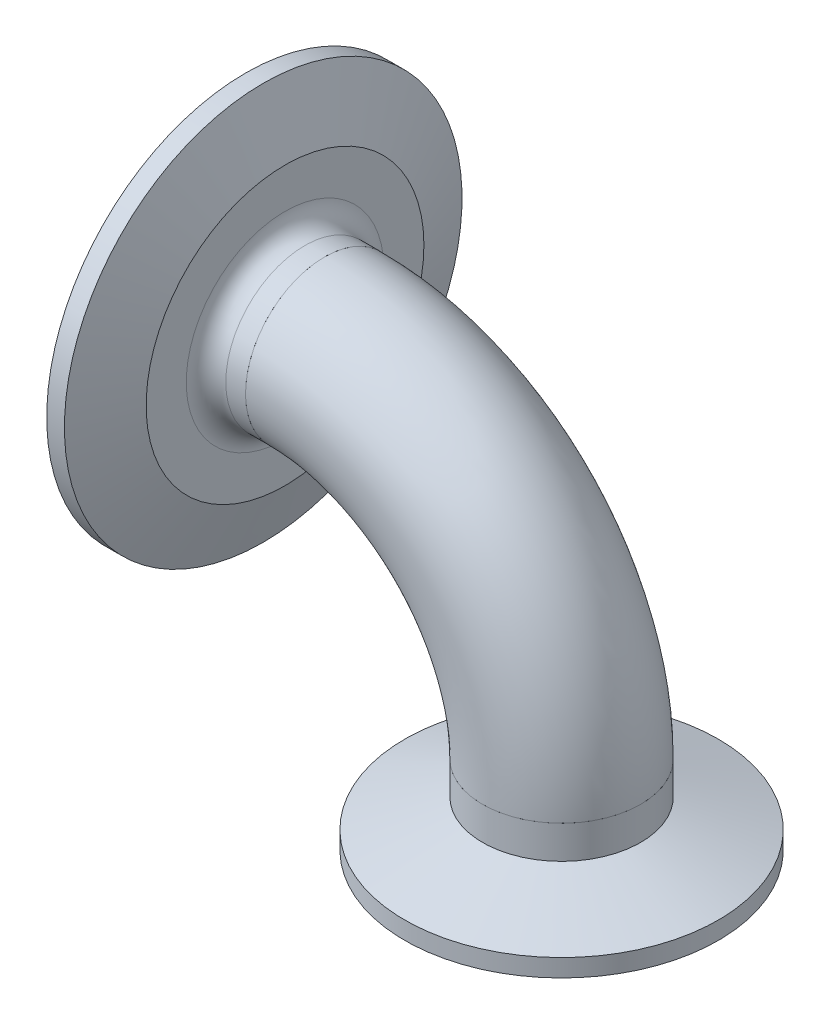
ISO-10303-21;
HEADER;
FILE_DESCRIPTION(('STEP AP214'),'2;1');
FILE_NAME('part.step','',(''),(''),'','','');
FILE_SCHEMA(('AUTOMOTIVE_DESIGN { 1 0 10303 214 1 1 1 1 }'));
ENDSEC;
DATA;
#1=APPLICATION_CONTEXT('core data for automotive mechanical design processes');
#2=APPLICATION_PROTOCOL_DEFINITION('international standard','automotive_design',2000,#1);
#3=PRODUCT_CONTEXT('',#1,'mechanical');
#4=PRODUCT('Part','Part','',(#3));
#5=PRODUCT_RELATED_PRODUCT_CATEGORY('part','',(#4));
#6=PRODUCT_DEFINITION_FORMATION('','',#4);
#7=PRODUCT_DEFINITION_CONTEXT('part definition',#1,'design');
#8=PRODUCT_DEFINITION('design','',#6,#7);
#9=PRODUCT_DEFINITION_SHAPE('','',#8);
#10=(LENGTH_UNIT() NAMED_UNIT(*) SI_UNIT(.MILLI.,.METRE.));
#11=(NAMED_UNIT(*) PLANE_ANGLE_UNIT() SI_UNIT($,.RADIAN.));
#12=(NAMED_UNIT(*) SI_UNIT($,.STERADIAN.) SOLID_ANGLE_UNIT());
#13=UNCERTAINTY_MEASURE_WITH_UNIT(LENGTH_MEASURE(1.E-05),#10,'distance_accuracy_value','');
#14=(GEOMETRIC_REPRESENTATION_CONTEXT(3) GLOBAL_UNCERTAINTY_ASSIGNED_CONTEXT((#13)) GLOBAL_UNIT_ASSIGNED_CONTEXT((#10,
#11,#12)) REPRESENTATION_CONTEXT('',''));
#15=CARTESIAN_POINT('',(0.,0.,0.));
#16=DIRECTION('',(0.,0.,1.));
#17=DIRECTION('',(1.,0.,0.));
#18=AXIS2_PLACEMENT_3D('',#15,#16,#17);
#19=CARTESIAN_POINT('',(7.06155520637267,16.9202870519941,51.7884539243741));
#20=DIRECTION('',(0.,0.,-1.));
#21=DIRECTION('',(-1.,0.,0.));
#22=AXIS2_PLACEMENT_3D('',#19,#20,#21);
#23=TOROIDAL_SURFACE('',#22,38.1,12.7);
#24=CARTESIAN_POINT('',(7.06155520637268,55.0202870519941,51.7884539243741));
#25=DIRECTION('',(-1.,0.,0.));
#26=DIRECTION('',(0.,0.,1.));
#27=AXIS2_PLACEMENT_3D('',#24,#25,#26);
#28=CIRCLE('',#27,12.7);
#29=CARTESIAN_POINT('',(7.06155520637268,67.7202870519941,51.7884539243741));
#30=VERTEX_POINT('',#29);
#31=EDGE_CURVE('P0_E10',#30,#30,#28,.T.);
#32=CARTESIAN_POINT('',(45.1615552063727,16.9202870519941,51.7884539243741));
#33=DIRECTION('',(0.,1.,0.));
#34=DIRECTION('',(0.,0.,1.));
#35=AXIS2_PLACEMENT_3D('',#32,#33,#34);
#36=CIRCLE('',#35,12.7);
#37=CARTESIAN_POINT('',(57.8615552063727,16.9202870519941,51.7884539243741));
#38=VERTEX_POINT('',#37);
#39=EDGE_CURVE('P0_E21',#38,#38,#36,.T.);
#40=CARTESIAN_POINT('',(7.06155520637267,16.9202870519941,51.7884539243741));
#41=DIRECTION('',(0.,0.,-1.));
#42=DIRECTION('',(-1.,0.,0.));
#43=AXIS2_PLACEMENT_3D('',#40,#41,#42);
#44=CIRCLE('',#43,50.8);
#45=EDGE_CURVE('',#30,#38,#44,.T.);
#46=ORIENTED_EDGE('',*,*,#31,.F.);
#47=ORIENTED_EDGE('',*,*,#39,.T.);
#48=ORIENTED_EDGE('',*,*,#45,.T.);
#49=ORIENTED_EDGE('',*,*,#45,.F.);
#50=EDGE_LOOP('',(#46,#48,#47,#49));
#51=FACE_BOUND('',#50,.T.);
#52=ADVANCED_FACE('P0_F15',(#51),#23,.T.);
#53=CARTESIAN_POINT('',(7.06155520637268,55.0202870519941,51.7884539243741));
#54=DIRECTION('',(-1.,0.,0.));
#55=DIRECTION('',(0.,0.,1.));
#56=AXIS2_PLACEMENT_3D('',#53,#54,#55);
#57=PLANE('',#56);
#58=CARTESIAN_POINT('',(7.06155520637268,55.0202870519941,51.7884539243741));
#59=DIRECTION('',(-1.,0.,0.));
#60=DIRECTION('',(0.,-1.,0.));
#61=AXIS2_PLACEMENT_3D('',#58,#59,#60);
#62=CIRCLE('',#61,11.049);
#63=CARTESIAN_POINT('',(7.06155520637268,66.0692870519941,51.7884539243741));
#64=VERTEX_POINT('',#63);
#65=EDGE_CURVE('P0_E25',#64,#64,#62,.T.);
#66=ORIENTED_EDGE('',*,*,#65,.F.);
#67=EDGE_LOOP('',(#66));
#68=FACE_BOUND('',#67,.T.);
#69=ORIENTED_EDGE('',*,*,#31,.T.);
#70=EDGE_LOOP('',(#69));
#71=FACE_BOUND('',#70,.T.);
#72=ADVANCED_FACE('P0_F46',(#68,#71),#57,.T.);
#73=CARTESIAN_POINT('',(45.1615552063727,16.9202870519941,51.7884539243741));
#74=DIRECTION('',(0.,1.,0.));
#75=DIRECTION('',(0.,0.,1.));
#76=AXIS2_PLACEMENT_3D('',#73,#74,#75);
#77=PLANE('',#76);
#78=CARTESIAN_POINT('',(45.1615552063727,16.9202870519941,51.7884539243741));
#79=DIRECTION('',(0.,1.,0.));
#80=DIRECTION('',(0.,0.,1.));
#81=AXIS2_PLACEMENT_3D('',#78,#79,#80);
#82=CIRCLE('',#81,11.049);
#83=CARTESIAN_POINT('',(56.2105552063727,16.9202870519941,51.7884539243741));
#84=VERTEX_POINT('',#83);
#85=EDGE_CURVE('P0_E29',#84,#84,#82,.T.);
#86=ORIENTED_EDGE('',*,*,#85,.T.);
#87=EDGE_LOOP('',(#86));
#88=FACE_BOUND('',#87,.T.);
#89=ORIENTED_EDGE('',*,*,#39,.F.);
#90=EDGE_LOOP('',(#89));
#91=FACE_BOUND('',#90,.T.);
#92=ADVANCED_FACE('P0_F35',(#88,#91),#77,.F.);
#93=CARTESIAN_POINT('',(7.06155520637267,16.9202870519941,51.7884539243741));
#94=DIRECTION('',(0.,0.,-1.));
#95=DIRECTION('',(-1.,0.,0.));
#96=AXIS2_PLACEMENT_3D('',#93,#94,#95);
#97=TOROIDAL_SURFACE('',#96,38.1,11.049);
#98=CARTESIAN_POINT('',(7.06155520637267,16.9202870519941,51.7884539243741));
#99=DIRECTION('',(0.,0.,-1.));
#100=DIRECTION('',(-1.,0.,0.));
#101=AXIS2_PLACEMENT_3D('',#98,#99,#100);
#102=CIRCLE('',#101,49.149);
#103=EDGE_CURVE('',#64,#84,#102,.T.);
#104=ORIENTED_EDGE('',*,*,#65,.T.);
#105=ORIENTED_EDGE('',*,*,#85,.F.);
#106=ORIENTED_EDGE('',*,*,#103,.T.);
#107=ORIENTED_EDGE('',*,*,#103,.F.);
#108=EDGE_LOOP('',(#104,#106,#105,#107));
#109=FACE_BOUND('',#108,.T.);
#110=ADVANCED_FACE('P0_F38',(#109),#97,.F.);
#111=CLOSED_SHELL('',(#52,#72,#92,#110));
#112=MANIFOLD_SOLID_BREP('P0_B1',#111);
#113=CARTESIAN_POINT('',(45.1615552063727,5.00768705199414,51.7884539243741));
#114=DIRECTION('',(0.,-1.,0.));
#115=DIRECTION('',(0.,0.,-1.));
#116=AXIS2_PLACEMENT_3D('',#113,#114,#115);
#117=TOROIDAL_SURFACE('',#116,23.6366084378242,0.787399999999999);
#118=CARTESIAN_POINT('',(45.1615552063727,4.22028705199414,51.7884539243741));
#119=DIRECTION('',(0.,-1.,0.));
#120=DIRECTION('',(0.,0.,-1.));
#121=AXIS2_PLACEMENT_3D('',#118,#119,#120);
#122=CIRCLE('',#121,23.6366084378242);
#123=CARTESIAN_POINT('',(45.1615552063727,4.22028705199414,28.1518454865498));
#124=VERTEX_POINT('',#123);
#125=EDGE_CURVE('P1_E49',#124,#124,#122,.T.);
#126=ORIENTED_EDGE('',*,*,#125,.T.);
#127=EDGE_LOOP('',(#126));
#128=FACE_BOUND('',#127,.T.);
#129=CARTESIAN_POINT('',(45.1615552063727,4.69474602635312,51.7884539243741));
#130=DIRECTION('',(0.,-1.,0.));
#131=DIRECTION('',(0.,0.,-1.));
#132=AXIS2_PLACEMENT_3D('',#129,#130,#131);
#133=CIRCLE('',#132,22.9140666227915);
#134=CARTESIAN_POINT('',(45.1615552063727,4.69474602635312,28.8743873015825));
#135=VERTEX_POINT('',#134);
#136=EDGE_CURVE('P1_E10',#135,#135,#133,.T.);
#137=ORIENTED_EDGE('',*,*,#136,.F.);
#138=EDGE_LOOP('',(#137));
#139=FACE_BOUND('',#138,.T.);
#140=ADVANCED_FACE('P1_F15',(#128,#139),#117,.T.);
#141=CARTESIAN_POINT('',(45.1615552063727,4.22028705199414,51.7884539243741));
#142=DIRECTION('',(0.,-1.,0.));
#143=DIRECTION('',(0.,0.,-1.));
#144=AXIS2_PLACEMENT_3D('',#141,#142,#143);
#145=TOROIDAL_SURFACE('',#144,21.8186,1.1938);
#146=CARTESIAN_POINT('',(45.1615552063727,4.69474602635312,51.7884539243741));
#147=DIRECTION('',(0.,-1.,0.));
#148=DIRECTION('',(0.,0.,-1.));
#149=AXIS2_PLACEMENT_3D('',#146,#147,#148);
#150=CIRCLE('',#149,20.7231333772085);
#151=CARTESIAN_POINT('',(45.1615552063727,4.69474602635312,31.0653205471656));
#152=VERTEX_POINT('',#151);
#153=EDGE_CURVE('P1_E21',#152,#152,#150,.T.);
#154=ORIENTED_EDGE('',*,*,#153,.F.);
#155=EDGE_LOOP('',(#154));
#156=FACE_BOUND('',#155,.T.);
#157=ORIENTED_EDGE('',*,*,#136,.T.);
#158=EDGE_LOOP('',(#157));
#159=FACE_BOUND('',#158,.T.);
#160=ADVANCED_FACE('P1_F98',(#156,#159),#145,.F.);
#161=CARTESIAN_POINT('',(45.1615552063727,5.00768705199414,51.7884539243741));
#162=DIRECTION('',(0.,-1.,0.));
#163=DIRECTION('',(0.,0.,-1.));
#164=AXIS2_PLACEMENT_3D('',#161,#162,#163);
#165=TOROIDAL_SURFACE('',#164,20.0005915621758,0.787399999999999);
#166=ORIENTED_EDGE('',*,*,#153,.T.);
#167=EDGE_LOOP('',(#166));
#168=FACE_BOUND('',#167,.T.);
#169=CARTESIAN_POINT('',(45.1615552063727,4.22028705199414,51.7884539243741));
#170=DIRECTION('',(0.,-1.,0.));
#171=DIRECTION('',(0.,0.,-1.));
#172=AXIS2_PLACEMENT_3D('',#169,#170,#171);
#173=CIRCLE('',#172,20.0005915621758);
#174=CARTESIAN_POINT('',(45.1615552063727,4.22028705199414,31.7878623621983));
#175=VERTEX_POINT('',#174);
#176=EDGE_CURVE('P1_E25',#175,#175,#173,.T.);
#177=ORIENTED_EDGE('',*,*,#176,.F.);
#178=EDGE_LOOP('',(#177));
#179=FACE_BOUND('',#178,.T.);
#180=ADVANCED_FACE('P1_F94',(#168,#179),#165,.T.);
#181=CARTESIAN_POINT('',(45.1615552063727,4.22028705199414,51.7884539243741));
#182=DIRECTION('',(0.,1.,0.));
#183=DIRECTION('',(0.,0.,1.));
#184=AXIS2_PLACEMENT_3D('',#181,#182,#183);
#185=PLANE('',#184);
#186=CARTESIAN_POINT('',(45.1615552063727,4.22028705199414,51.7884539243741));
#187=DIRECTION('',(0.,-1.,0.));
#188=DIRECTION('',(0.,0.,-1.));
#189=AXIS2_PLACEMENT_3D('',#186,#187,#188);
#190=CIRCLE('',#189,11.049);
#191=CARTESIAN_POINT('',(45.1615552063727,4.22028705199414,40.7394539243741));
#192=VERTEX_POINT('',#191);
#193=EDGE_CURVE('P1_E29',#192,#192,#190,.T.);
#194=ORIENTED_EDGE('',*,*,#193,.F.);
#195=EDGE_LOOP('',(#194));
#196=FACE_BOUND('',#195,.T.);
#197=ORIENTED_EDGE('',*,*,#176,.T.);
#198=EDGE_LOOP('',(#197));
#199=FACE_BOUND('',#198,.T.);
#200=ADVANCED_FACE('P1_F87',(#196,#199),#185,.F.);
#201=CARTESIAN_POINT('',(45.1615552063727,4.22028705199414,51.7884539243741));
#202=DIRECTION('',(0.,-1.,0.));
#203=DIRECTION('',(0.,0.,-1.));
#204=AXIS2_PLACEMENT_3D('',#201,#202,#203);
#205=CYLINDRICAL_SURFACE('',#204,11.049);
#206=ORIENTED_EDGE('',*,*,#193,.T.);
#207=EDGE_LOOP('',(#206));
#208=FACE_BOUND('',#207,.T.);
#209=CARTESIAN_POINT('',(45.1615552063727,16.9202870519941,51.7884539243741));
#210=DIRECTION('',(0.,-1.,0.));
#211=DIRECTION('',(0.,0.,-1.));
#212=AXIS2_PLACEMENT_3D('',#209,#210,#211);
#213=CIRCLE('',#212,11.049);
#214=CARTESIAN_POINT('',(45.1615552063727,16.9202870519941,40.7394539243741));
#215=VERTEX_POINT('',#214);
#216=EDGE_CURVE('P1_E34',#215,#215,#213,.T.);
#217=ORIENTED_EDGE('',*,*,#216,.F.);
#218=EDGE_LOOP('',(#217));
#219=FACE_BOUND('',#218,.T.);
#220=ADVANCED_FACE('P1_F82',(#208,#219),#205,.F.);
#221=CARTESIAN_POINT('',(45.1615552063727,16.9202870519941,51.7884539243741));
#222=DIRECTION('',(0.,-1.,0.));
#223=DIRECTION('',(0.,0.,-1.));
#224=AXIS2_PLACEMENT_3D('',#221,#222,#223);
#225=PLANE('',#224);
#226=CARTESIAN_POINT('',(45.1615552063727,16.9202870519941,51.7884539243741));
#227=DIRECTION('',(0.,-1.,0.));
#228=DIRECTION('',(0.,0.,-1.));
#229=AXIS2_PLACEMENT_3D('',#226,#227,#228);
#230=CIRCLE('',#229,12.7);
#231=CARTESIAN_POINT('',(45.1615552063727,16.9202870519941,39.0884539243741));
#232=VERTEX_POINT('',#231);
#233=EDGE_CURVE('P1_E37',#232,#232,#230,.T.);
#234=ORIENTED_EDGE('',*,*,#233,.F.);
#235=EDGE_LOOP('',(#234));
#236=FACE_BOUND('',#235,.T.);
#237=ORIENTED_EDGE('',*,*,#216,.T.);
#238=EDGE_LOOP('',(#237));
#239=FACE_BOUND('',#238,.T.);
#240=ADVANCED_FACE('P1_F76',(#236,#239),#225,.F.);
#241=CARTESIAN_POINT('',(45.1615552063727,4.22028705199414,51.7884539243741));
#242=DIRECTION('',(0.,-1.,0.));
#243=DIRECTION('',(0.,0.,-1.));
#244=AXIS2_PLACEMENT_3D('',#241,#242,#243);
#245=CYLINDRICAL_SURFACE('',#244,12.7);
#246=CARTESIAN_POINT('',(45.1615552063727,11.613550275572,51.7884539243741));
#247=DIRECTION('',(0.,-1.,0.));
#248=DIRECTION('',(0.,0.,-1.));
#249=AXIS2_PLACEMENT_3D('',#246,#247,#248);
#250=CIRCLE('',#249,12.7);
#251=CARTESIAN_POINT('',(45.1615552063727,11.613550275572,39.0884539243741));
#252=VERTEX_POINT('',#251);
#253=EDGE_CURVE('P1_E40',#252,#252,#250,.T.);
#254=ORIENTED_EDGE('',*,*,#253,.F.);
#255=EDGE_LOOP('',(#254));
#256=FACE_BOUND('',#255,.T.);
#257=ORIENTED_EDGE('',*,*,#233,.T.);
#258=EDGE_LOOP('',(#257));
#259=FACE_BOUND('',#258,.T.);
#260=ADVANCED_FACE('P1_F70',(#256,#259),#245,.T.);
#261=CARTESIAN_POINT('',(45.1615552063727,11.613550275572,51.7884539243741));
#262=DIRECTION('',(0.,-1.,0.));
#263=DIRECTION('',(0.,0.,-1.));
#264=AXIS2_PLACEMENT_3D('',#261,#262,#263);
#265=CONICAL_SURFACE('',#264,12.7,1.22173047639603);
#266=CARTESIAN_POINT('',(45.1615552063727,7.06508705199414,51.7884539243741));
#267=DIRECTION('',(0.,-1.,0.));
#268=DIRECTION('',(0.,0.,-1.));
#269=AXIS2_PLACEMENT_3D('',#266,#267,#268);
#270=CIRCLE('',#269,25.1968);
#271=CARTESIAN_POINT('',(45.1615552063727,7.06508705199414,26.5916539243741));
#272=VERTEX_POINT('',#271);
#273=EDGE_CURVE('P1_E43',#272,#272,#270,.T.);
#274=ORIENTED_EDGE('',*,*,#273,.F.);
#275=EDGE_LOOP('',(#274));
#276=FACE_BOUND('',#275,.T.);
#277=ORIENTED_EDGE('',*,*,#253,.T.);
#278=EDGE_LOOP('',(#277));
#279=FACE_BOUND('',#278,.T.);
#280=ADVANCED_FACE('P1_F64',(#276,#279),#265,.T.);
#281=CARTESIAN_POINT('',(45.1615552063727,4.22028705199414,51.7884539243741));
#282=DIRECTION('',(0.,-1.,0.));
#283=DIRECTION('',(0.,0.,-1.));
#284=AXIS2_PLACEMENT_3D('',#281,#282,#283);
#285=CYLINDRICAL_SURFACE('',#284,25.1968);
#286=CARTESIAN_POINT('',(45.1615552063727,4.22028705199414,51.7884539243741));
#287=DIRECTION('',(0.,-1.,0.));
#288=DIRECTION('',(0.,0.,-1.));
#289=AXIS2_PLACEMENT_3D('',#286,#287,#288);
#290=CIRCLE('',#289,25.1968);
#291=CARTESIAN_POINT('',(45.1615552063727,4.22028705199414,26.5916539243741));
#292=VERTEX_POINT('',#291);
#293=EDGE_CURVE('P1_E46',#292,#292,#290,.T.);
#294=ORIENTED_EDGE('',*,*,#293,.F.);
#295=EDGE_LOOP('',(#294));
#296=FACE_BOUND('',#295,.T.);
#297=ORIENTED_EDGE('',*,*,#273,.T.);
#298=EDGE_LOOP('',(#297));
#299=FACE_BOUND('',#298,.T.);
#300=ADVANCED_FACE('P1_F58',(#296,#299),#285,.T.);
#301=CARTESIAN_POINT('',(45.1615552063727,4.22028705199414,51.7884539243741));
#302=DIRECTION('',(0.,1.,0.));
#303=DIRECTION('',(0.,0.,1.));
#304=AXIS2_PLACEMENT_3D('',#301,#302,#303);
#305=PLANE('',#304);
#306=ORIENTED_EDGE('',*,*,#125,.F.);
#307=EDGE_LOOP('',(#306));
#308=FACE_BOUND('',#307,.T.);
#309=ORIENTED_EDGE('',*,*,#293,.T.);
#310=EDGE_LOOP('',(#309));
#311=FACE_BOUND('',#310,.T.);
#312=ADVANCED_FACE('P1_F55',(#308,#311),#305,.F.);
#313=CLOSED_SHELL('',(#140,#160,#180,#200,#220,#240,#260,#280,#300,#312));
#314=MANIFOLD_SOLID_BREP('P1_B1',#313);
#315=CARTESIAN_POINT('',(7.06155520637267,63.6062002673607,58.74276879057));
#316=DIRECTION('',(-1.,0.,0.));
#317=DIRECTION('',(0.,0.629406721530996,-0.777076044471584));
#318=AXIS2_PLACEMENT_3D('',#315,#316,#317);
#319=PLANE('',#318);
#320=CARTESIAN_POINT('',(7.06155520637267,55.0202870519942,51.788453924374));
#321=DIRECTION('',(-1.,0.,0.));
#322=DIRECTION('',(0.,0.629406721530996,-0.777076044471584));
#323=AXIS2_PLACEMENT_3D('',#320,#321,#322);
#324=CIRCLE('',#323,12.7);
#325=CARTESIAN_POINT('',(7.06155520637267,63.0137524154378,41.9195881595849));
#326=VERTEX_POINT('',#325);
#327=EDGE_CURVE('P2_E9',#326,#326,#324,.T.);
#328=ORIENTED_EDGE('',*,*,#327,.F.);
#329=EDGE_LOOP('',(#328));
#330=FACE_BOUND('',#329,.T.);
#331=CARTESIAN_POINT('',(7.06155520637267,55.0202870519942,51.788453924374));
#332=DIRECTION('',(-1.,0.,0.));
#333=DIRECTION('',(0.,0.629406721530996,-0.777076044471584));
#334=AXIS2_PLACEMENT_3D('',#331,#332,#333);
#335=CIRCLE('',#334,11.049);
#336=CARTESIAN_POINT('',(7.06155520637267,61.9746019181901,43.2025407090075));
#337=VERTEX_POINT('',#336);
#338=EDGE_CURVE('P2_E63',#337,#337,#335,.T.);
#339=ORIENTED_EDGE('',*,*,#338,.T.);
#340=EDGE_LOOP('',(#339));
#341=FACE_BOUND('',#340,.T.);
#342=ADVANCED_FACE('P2_F14',(#330,#341),#319,.F.);
#343=CARTESIAN_POINT('',(-5.63844479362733,55.0202870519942,51.788453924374));
#344=DIRECTION('',(-1.,0.,0.));
#345=DIRECTION('',(0.,0.629406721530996,-0.777076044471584));
#346=AXIS2_PLACEMENT_3D('',#343,#344,#345);
#347=CYLINDRICAL_SURFACE('',#346,12.7);
#348=CARTESIAN_POINT('',(3.88655520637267,55.0202870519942,51.788453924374));
#349=DIRECTION('',(-1.,0.,0.));
#350=DIRECTION('',(0.,0.629406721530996,-0.777076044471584));
#351=AXIS2_PLACEMENT_3D('',#348,#349,#350);
#352=CIRCLE('',#351,12.7);
#353=CARTESIAN_POINT('',(3.88655520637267,63.0137524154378,41.9195881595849));
#354=VERTEX_POINT('',#353);
#355=EDGE_CURVE('P2_E20',#354,#354,#352,.T.);
#356=ORIENTED_EDGE('',*,*,#355,.F.);
#357=EDGE_LOOP('',(#356));
#358=FACE_BOUND('',#357,.T.);
#359=ORIENTED_EDGE('',*,*,#327,.T.);
#360=EDGE_LOOP('',(#359));
#361=FACE_BOUND('',#360,.T.);
#362=ADVANCED_FACE('P2_F142',(#358,#361),#347,.T.);
#363=CARTESIAN_POINT('',(3.88655520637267,55.0202870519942,51.788453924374));
#364=DIRECTION('',(-1.,0.,0.));
#365=DIRECTION('',(0.,0.629406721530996,-0.777076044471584));
#366=AXIS2_PLACEMENT_3D('',#363,#364,#365);
#367=TOROIDAL_SURFACE('',#366,15.875,3.175);
#368=CARTESIAN_POINT('',(0.711555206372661,55.0202870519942,51.788453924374));
#369=DIRECTION('',(-1.,0.,0.));
#370=DIRECTION('',(0.,0.629406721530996,-0.777076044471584));
#371=AXIS2_PLACEMENT_3D('',#368,#369,#370);
#372=CIRCLE('',#371,15.875);
#373=CARTESIAN_POINT('',(0.711555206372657,65.0121187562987,39.4523717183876));
#374=VERTEX_POINT('',#373);
#375=EDGE_CURVE('P2_E24',#374,#374,#372,.T.);
#376=ORIENTED_EDGE('',*,*,#375,.F.);
#377=EDGE_LOOP('',(#376));
#378=FACE_BOUND('',#377,.T.);
#379=ORIENTED_EDGE('',*,*,#355,.T.);
#380=EDGE_LOOP('',(#379));
#381=FACE_BOUND('',#380,.T.);
#382=ADVANCED_FACE('P2_F137',(#378,#381),#367,.F.);
#383=CARTESIAN_POINT('',(0.711555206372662,67.3563692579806,61.7802856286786));
#384=DIRECTION('',(-1.,0.,0.));
#385=DIRECTION('',(0.,0.629406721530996,-0.777076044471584));
#386=AXIS2_PLACEMENT_3D('',#383,#384,#385);
#387=PLANE('',#386);
#388=CARTESIAN_POINT('',(0.711555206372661,55.0202870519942,51.788453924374));
#389=DIRECTION('',(-1.,0.,0.));
#390=DIRECTION('',(0.,0.629406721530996,-0.777076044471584));
#391=AXIS2_PLACEMENT_3D('',#388,#389,#390);
#392=CIRCLE('',#391,22.3227421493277);
#393=CARTESIAN_POINT('',(0.711555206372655,69.0703710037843,34.4419857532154));
#394=VERTEX_POINT('',#393);
#395=EDGE_CURVE('P2_E28',#394,#394,#392,.T.);
#396=ORIENTED_EDGE('',*,*,#395,.F.);
#397=EDGE_LOOP('',(#396));
#398=FACE_BOUND('',#397,.T.);
#399=ORIENTED_EDGE('',*,*,#375,.T.);
#400=EDGE_LOOP('',(#399));
#401=FACE_BOUND('',#400,.T.);
#402=ADVANCED_FACE('P2_F131',(#398,#401),#387,.F.);
#403=CARTESIAN_POINT('',(0.711555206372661,55.0202870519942,51.788453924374));
#404=DIRECTION('',(-1.,0.,0.));
#405=DIRECTION('',(0.,0.629406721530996,-0.777076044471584));
#406=AXIS2_PLACEMENT_3D('',#403,#404,#405);
#407=CONICAL_SURFACE('',#406,22.3227421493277,1.22173047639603);
#408=CARTESIAN_POINT('',(-2.79364479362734,55.0202870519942,51.788453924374));
#409=DIRECTION('',(-1.,0.,0.));
#410=DIRECTION('',(0.,0.629406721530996,-0.777076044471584));
#411=AXIS2_PLACEMENT_3D('',#408,#409,#410);
#412=CIRCLE('',#411,31.9532);
#413=CARTESIAN_POINT('',(-2.79364479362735,75.1318459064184,26.9583876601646));
#414=VERTEX_POINT('',#413);
#415=EDGE_CURVE('P2_E33',#414,#414,#412,.T.);
#416=ORIENTED_EDGE('',*,*,#415,.F.);
#417=EDGE_LOOP('',(#416));
#418=FACE_BOUND('',#417,.T.);
#419=ORIENTED_EDGE('',*,*,#395,.T.);
#420=EDGE_LOOP('',(#419));
#421=FACE_BOUND('',#420,.T.);
#422=ADVANCED_FACE('P2_F125',(#418,#421),#407,.T.);
#423=CARTESIAN_POINT('',(-5.63844479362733,55.0202870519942,51.788453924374));
#424=DIRECTION('',(-1.,0.,0.));
#425=DIRECTION('',(0.,0.629406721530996,-0.777076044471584));
#426=AXIS2_PLACEMENT_3D('',#423,#424,#425);
#427=CYLINDRICAL_SURFACE('',#426,31.9532);
#428=CARTESIAN_POINT('',(-5.63844479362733,55.0202870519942,51.788453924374));
#429=DIRECTION('',(-1.,0.,0.));
#430=DIRECTION('',(0.,0.629406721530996,-0.777076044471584));
#431=AXIS2_PLACEMENT_3D('',#428,#429,#430);
#432=CIRCLE('',#431,31.9532);
#433=CARTESIAN_POINT('',(-5.63844479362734,75.1318459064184,26.9583876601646));
#434=VERTEX_POINT('',#433);
#435=EDGE_CURVE('P2_E36',#434,#434,#432,.T.);
#436=ORIENTED_EDGE('',*,*,#435,.F.);
#437=EDGE_LOOP('',(#436));
#438=FACE_BOUND('',#437,.T.);
#439=ORIENTED_EDGE('',*,*,#415,.T.);
#440=EDGE_LOOP('',(#439));
#441=FACE_BOUND('',#440,.T.);
#442=ADVANCED_FACE('P2_F119',(#438,#441),#427,.T.);
#443=CARTESIAN_POINT('',(-5.63844479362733,55.0202870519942,51.788453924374));
#444=DIRECTION('',(-1.,0.,0.));
#445=DIRECTION('',(0.,0.629406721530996,-0.777076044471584));
#446=AXIS2_PLACEMENT_3D('',#443,#444,#445);
#447=CONICAL_SURFACE('',#446,31.9532,1.56939586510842);
#448=CARTESIAN_POINT('',(-5.63593232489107,55.0202870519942,51.788453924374));
#449=DIRECTION('',(-1.,0.,0.));
#450=DIRECTION('',(0.,0.629406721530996,-0.777076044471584));
#451=AXIS2_PLACEMENT_3D('',#448,#449,#450);
#452=CIRCLE('',#451,30.1591722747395);
#453=CARTESIAN_POINT('',(-5.63593232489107,74.0026727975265,28.3524836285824));
#454=VERTEX_POINT('',#453);
#455=EDGE_CURVE('P2_E39',#454,#454,#452,.T.);
#456=ORIENTED_EDGE('',*,*,#455,.F.);
#457=EDGE_LOOP('',(#456));
#458=FACE_BOUND('',#457,.T.);
#459=ORIENTED_EDGE('',*,*,#435,.T.);
#460=EDGE_LOOP('',(#459));
#461=FACE_BOUND('',#460,.T.);
#462=ADVANCED_FACE('P2_F113',(#458,#461),#447,.F.);
#463=CARTESIAN_POINT('',(-4.84853232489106,55.0202870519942,51.788453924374));
#464=DIRECTION('',(-1.,0.,0.));
#465=DIRECTION('',(0.,0.629406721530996,-0.777076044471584));
#466=AXIS2_PLACEMENT_3D('',#463,#464,#465);
#467=TOROIDAL_SURFACE('',#466,30.1591722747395,0.787400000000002);
#468=CARTESIAN_POINT('',(-5.1561940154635,55.0202870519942,51.788453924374));
#469=DIRECTION('',(-1.,0.,0.));
#470=DIRECTION('',(0.,0.629406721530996,-0.777076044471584));
#471=AXIS2_PLACEMENT_3D('',#468,#469,#470);
#472=CIRCLE('',#471,29.434366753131);
#473=CARTESIAN_POINT('',(-5.15619401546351,73.5464753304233,28.9157126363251));
#474=VERTEX_POINT('',#473);
#475=EDGE_CURVE('P2_E42',#474,#474,#472,.T.);
#476=ORIENTED_EDGE('',*,*,#475,.F.);
#477=EDGE_LOOP('',(#476));
#478=FACE_BOUND('',#477,.T.);
#479=ORIENTED_EDGE('',*,*,#455,.T.);
#480=EDGE_LOOP('',(#479));
#481=FACE_BOUND('',#480,.T.);
#482=ADVANCED_FACE('P2_F107',(#478,#481),#467,.T.);
#483=CARTESIAN_POINT('',(-5.1561940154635,55.0202870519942,51.788453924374));
#484=DIRECTION('',(-1.,0.,0.));
#485=DIRECTION('',(0.,0.629406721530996,-0.777076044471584));
#486=AXIS2_PLACEMENT_3D('',#483,#484,#485);
#487=CONICAL_SURFACE('',#486,29.434366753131,0.401425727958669);
#488=CARTESIAN_POINT('',(-4.76307750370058,55.0202870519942,51.788453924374));
#489=DIRECTION('',(-1.,0.,0.));
#490=DIRECTION('',(0.,0.629406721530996,-0.777076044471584));
#491=AXIS2_PLACEMENT_3D('',#488,#489,#490);
#492=CIRCLE('',#491,29.2674986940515);
#493=CARTESIAN_POINT('',(-4.76307750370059,73.4414474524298,29.0453818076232));
#494=VERTEX_POINT('',#493);
#495=EDGE_CURVE('P2_E45',#494,#494,#492,.T.);
#496=ORIENTED_EDGE('',*,*,#495,.F.);
#497=EDGE_LOOP('',(#496));
#498=FACE_BOUND('',#497,.T.);
#499=ORIENTED_EDGE('',*,*,#475,.T.);
#500=EDGE_LOOP('',(#499));
#501=FACE_BOUND('',#500,.T.);
#502=ADVANCED_FACE('P2_F101',(#498,#501),#487,.F.);
#503=CARTESIAN_POINT('',(-5.22953232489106,55.0202870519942,51.788453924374));
#504=DIRECTION('',(-1.,0.,0.));
#505=DIRECTION('',(0.,0.629406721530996,-0.777076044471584));
#506=AXIS2_PLACEMENT_3D('',#503,#504,#505);
#507=TOROIDAL_SURFACE('',#506,28.1686,1.1938);
#508=CARTESIAN_POINT('',(-4.76307750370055,55.0202870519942,51.788453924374));
#509=DIRECTION('',(-1.,0.,0.));
#510=DIRECTION('',(0.,0.629406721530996,-0.777076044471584));
#511=AXIS2_PLACEMENT_3D('',#508,#509,#510);
#512=CIRCLE('',#511,27.0697013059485);
#513=CARTESIAN_POINT('',(-4.76307750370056,72.0581390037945,30.7532375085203));
#514=VERTEX_POINT('',#513);
#515=EDGE_CURVE('P2_E48',#514,#514,#512,.T.);
#516=ORIENTED_EDGE('',*,*,#515,.F.);
#517=EDGE_LOOP('',(#516));
#518=FACE_BOUND('',#517,.T.);
#519=ORIENTED_EDGE('',*,*,#495,.T.);
#520=EDGE_LOOP('',(#519));
#521=FACE_BOUND('',#520,.T.);
#522=ADVANCED_FACE('P2_F95',(#518,#521),#507,.F.);
#523=CARTESIAN_POINT('',(-4.76307750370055,55.0202870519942,51.788453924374));
#524=DIRECTION('',(1.,0.,0.));
#525=DIRECTION('',(0.,-0.629406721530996,0.777076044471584));
#526=AXIS2_PLACEMENT_3D('',#523,#524,#525);
#527=CONICAL_SURFACE('',#526,27.0697013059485,0.401425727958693);
#528=CARTESIAN_POINT('',(-5.15619401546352,55.0202870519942,51.788453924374));
#529=DIRECTION('',(-1.,0.,0.));
#530=DIRECTION('',(0.,0.629406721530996,-0.777076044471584));
#531=AXIS2_PLACEMENT_3D('',#528,#529,#530);
#532=CIRCLE('',#531,26.9028332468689);
#533=CARTESIAN_POINT('',(-5.15619401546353,71.953111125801,30.8829066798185));
#534=VERTEX_POINT('',#533);
#535=EDGE_CURVE('P2_E51',#534,#534,#532,.T.);
#536=ORIENTED_EDGE('',*,*,#535,.F.);
#537=EDGE_LOOP('',(#536));
#538=FACE_BOUND('',#537,.T.);
#539=ORIENTED_EDGE('',*,*,#515,.T.);
#540=EDGE_LOOP('',(#539));
#541=FACE_BOUND('',#540,.T.);
#542=ADVANCED_FACE('P2_F89',(#538,#541),#527,.T.);
#543=CARTESIAN_POINT('',(-4.84853232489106,55.0202870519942,51.788453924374));
#544=DIRECTION('',(-1.,0.,0.));
#545=DIRECTION('',(0.,0.629406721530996,-0.777076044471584));
#546=AXIS2_PLACEMENT_3D('',#543,#544,#545);
#547=TOROIDAL_SURFACE('',#546,26.1780277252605,0.787400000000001);
#548=CARTESIAN_POINT('',(-5.63593232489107,55.0202870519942,51.788453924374));
#549=DIRECTION('',(-1.,0.,0.));
#550=DIRECTION('',(0.,0.629406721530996,-0.777076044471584));
#551=AXIS2_PLACEMENT_3D('',#548,#549,#550);
#552=CIRCLE('',#551,26.1780277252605);
#553=CARTESIAN_POINT('',(-5.63593232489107,71.4969136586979,31.4461356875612));
#554=VERTEX_POINT('',#553);
#555=EDGE_CURVE('P2_E54',#554,#554,#552,.T.);
#556=ORIENTED_EDGE('',*,*,#555,.F.);
#557=EDGE_LOOP('',(#556));
#558=FACE_BOUND('',#557,.T.);
#559=ORIENTED_EDGE('',*,*,#535,.T.);
#560=EDGE_LOOP('',(#559));
#561=FACE_BOUND('',#560,.T.);
#562=ADVANCED_FACE('P2_F83',(#558,#561),#547,.T.);
#563=CARTESIAN_POINT('',(-5.63593232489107,55.0202870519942,51.788453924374));
#564=DIRECTION('',(1.,0.,0.));
#565=DIRECTION('',(0.,-0.629406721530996,0.777076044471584));
#566=AXIS2_PLACEMENT_3D('',#563,#564,#565);
#567=CONICAL_SURFACE('',#566,26.1780277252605,1.56976197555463);
#568=CARTESIAN_POINT('',(-5.63844479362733,55.0202870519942,51.788453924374));
#569=DIRECTION('',(-1.,0.,0.));
#570=DIRECTION('',(0.,0.629406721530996,-0.777076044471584));
#571=AXIS2_PLACEMENT_3D('',#568,#569,#570);
#572=CIRCLE('',#571,23.749);
#573=CARTESIAN_POINT('',(-5.63844479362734,69.9680672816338,33.3336749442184));
#574=VERTEX_POINT('',#573);
#575=EDGE_CURVE('P2_E57',#574,#574,#572,.T.);
#576=ORIENTED_EDGE('',*,*,#575,.F.);
#577=EDGE_LOOP('',(#576));
#578=FACE_BOUND('',#577,.T.);
#579=ORIENTED_EDGE('',*,*,#555,.T.);
#580=EDGE_LOOP('',(#579));
#581=FACE_BOUND('',#580,.T.);
#582=ADVANCED_FACE('P2_F77',(#578,#581),#567,.T.);
#583=CARTESIAN_POINT('',(-5.63844479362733,55.0202870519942,51.788453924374));
#584=DIRECTION('',(-1.,0.,0.));
#585=DIRECTION('',(0.,0.629406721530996,-0.777076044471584));
#586=AXIS2_PLACEMENT_3D('',#583,#584,#585);
#587=CONICAL_SURFACE('',#586,23.749,1.11543992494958);
#588=CARTESIAN_POINT('',(0.580472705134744,55.0202870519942,51.788453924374));
#589=DIRECTION('',(-1.,0.,0.));
#590=DIRECTION('',(0.,0.629406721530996,-0.777076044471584));
#591=AXIS2_PLACEMENT_3D('',#588,#589,#590);
#592=CIRCLE('',#591,11.049);
#593=CARTESIAN_POINT('',(0.580472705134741,61.9746019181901,43.2025407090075));
#594=VERTEX_POINT('',#593);
#595=EDGE_CURVE('P2_E60',#594,#594,#592,.T.);
#596=ORIENTED_EDGE('',*,*,#595,.F.);
#597=EDGE_LOOP('',(#596));
#598=FACE_BOUND('',#597,.T.);
#599=ORIENTED_EDGE('',*,*,#575,.T.);
#600=EDGE_LOOP('',(#599));
#601=FACE_BOUND('',#600,.T.);
#602=ADVANCED_FACE('P2_F71',(#598,#601),#587,.F.);
#603=CARTESIAN_POINT('',(-5.63844479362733,55.0202870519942,51.788453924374));
#604=DIRECTION('',(-1.,0.,0.));
#605=DIRECTION('',(0.,0.629406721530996,-0.777076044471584));
#606=AXIS2_PLACEMENT_3D('',#603,#604,#605);
#607=CYLINDRICAL_SURFACE('',#606,11.049);
#608=ORIENTED_EDGE('',*,*,#338,.F.);
#609=EDGE_LOOP('',(#608));
#610=FACE_BOUND('',#609,.T.);
#611=ORIENTED_EDGE('',*,*,#595,.T.);
#612=EDGE_LOOP('',(#611));
#613=FACE_BOUND('',#612,.T.);
#614=ADVANCED_FACE('P2_F68',(#610,#613),#607,.F.);
#615=CLOSED_SHELL('',(#342,#362,#382,#402,#422,#442,#462,#482,#502,#522,#542,#562,#582,#602,#614));
#616=MANIFOLD_SOLID_BREP('P2_B1',#615);
#617=ADVANCED_BREP_SHAPE_REPRESENTATION('',(#18,#112,#314,#616),#14);
#618=SHAPE_DEFINITION_REPRESENTATION(#9,#617);
ENDSEC;
END-ISO-10303-21;
